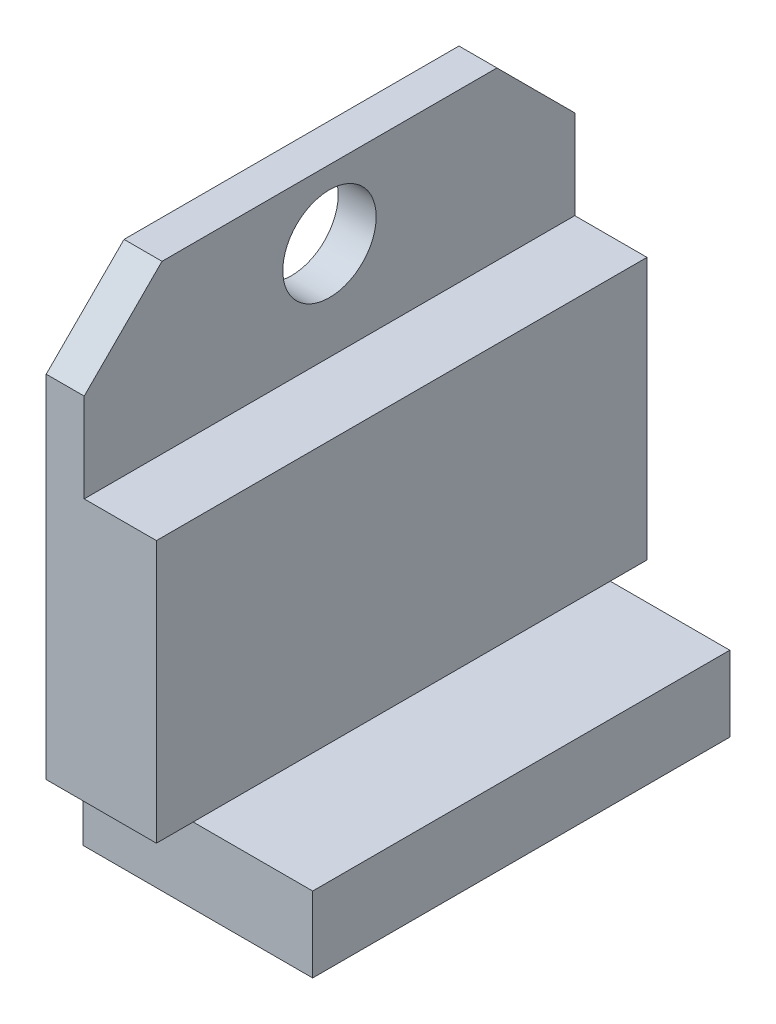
from build123d import *

# Parameters (mm, degrees)
SKETCH1_W      = 20.0152
SKETCH1_H      = 17.5006
SKETCH1_R      = 1.905
EXTRUDE1_DEPTH = 1.5494
CHAMFER1_SIZE  = 3.175
SKETCH2_W      = 20.0152
SKETCH2_H      = 10.6934
EXTRUDE2_DEPTH = 2.9464
SKETCH3_W      = 9.3726
SKETCH3_H      = 17.018
EXTRUDE3_DEPTH = 3.0734


with BuildPart() as part:
    # Sketch1 → Extrude1 (new body)
    with BuildSketch(Plane(origin=(0, 0, 0), x_dir=(0, 0, -1), z_dir=(1, 0, 0))):
        with Locations((10.0076, 8.7503)):
            Rectangle(SKETCH1_W, SKETCH1_H)
        with Locations((10.0076, 14.7066)):
            Circle(SKETCH1_R, mode=Mode.SUBTRACT)
    extrude(amount=EXTRUDE1_DEPTH)

    # Chamfer1
    chamfer1_edges = [part.edges().sort_by_distance(p)[0] for p in [
        (0.7747, 17.5006, 0),
        (0.7747, 17.5006, -20.0152),
    ]]
    chamfer(chamfer1_edges, length=CHAMFER1_SIZE)

    # Sketch2 → Extrude2 (add)
    with BuildSketch(Plane(origin=(1.5494, 0, 0), x_dir=(0, 0, -1), z_dir=(1, 0, 0))):
        with Locations((10.0076, 5.3467)):
            Rectangle(SKETCH2_W, SKETCH2_H)
    extrude(amount=EXTRUDE2_DEPTH)

    # Sketch3 → Extrude3 (add)
    with BuildSketch(Plane.XZ):
        with Locations((4.6863, -10.0076)):
            Rectangle(SKETCH3_W, SKETCH3_H)
    extrude(amount=EXTRUDE3_DEPTH)


solid = part.part
